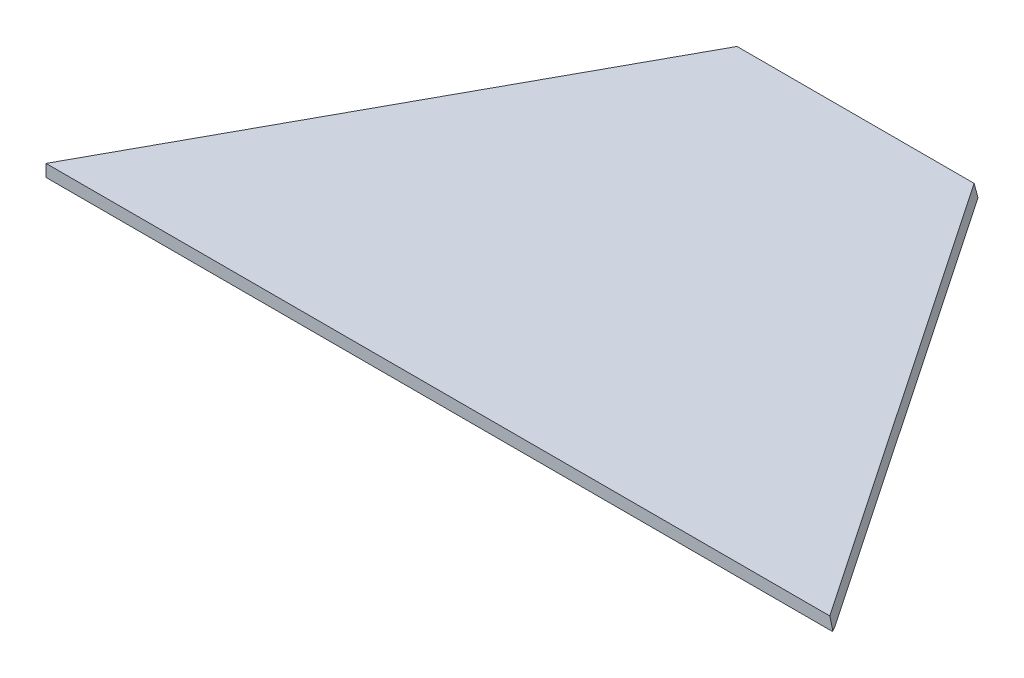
ISO-10303-21;
HEADER;
FILE_DESCRIPTION(('STEP AP214'),'2;1');
FILE_NAME('part.step','',(''),(''),'','','');
FILE_SCHEMA(('AUTOMOTIVE_DESIGN { 1 0 10303 214 1 1 1 1 }'));
ENDSEC;
DATA;
#1=APPLICATION_CONTEXT('core data for automotive mechanical design processes');
#2=APPLICATION_PROTOCOL_DEFINITION('international standard','automotive_design',2000,#1);
#3=PRODUCT_CONTEXT('',#1,'mechanical');
#4=PRODUCT('Part','Part','',(#3));
#5=PRODUCT_RELATED_PRODUCT_CATEGORY('part','',(#4));
#6=PRODUCT_DEFINITION_FORMATION('','',#4);
#7=PRODUCT_DEFINITION_CONTEXT('part definition',#1,'design');
#8=PRODUCT_DEFINITION('design','',#6,#7);
#9=PRODUCT_DEFINITION_SHAPE('','',#8);
#10=(LENGTH_UNIT() NAMED_UNIT(*) SI_UNIT(.MILLI.,.METRE.));
#11=(NAMED_UNIT(*) PLANE_ANGLE_UNIT() SI_UNIT($,.RADIAN.));
#12=(NAMED_UNIT(*) SI_UNIT($,.STERADIAN.) SOLID_ANGLE_UNIT());
#13=UNCERTAINTY_MEASURE_WITH_UNIT(LENGTH_MEASURE(1.E-05),#10,'distance_accuracy_value','');
#14=(GEOMETRIC_REPRESENTATION_CONTEXT(3) GLOBAL_UNCERTAINTY_ASSIGNED_CONTEXT((#13)) GLOBAL_UNIT_ASSIGNED_CONTEXT((#10,
#11,#12)) REPRESENTATION_CONTEXT('',''));
#15=CARTESIAN_POINT('',(0.,0.,0.));
#16=DIRECTION('',(0.,0.,1.));
#17=DIRECTION('',(1.,0.,0.));
#18=AXIS2_PLACEMENT_3D('',#15,#16,#17);
#19=CARTESIAN_POINT('',(-97.,3.,0.));
#20=DIRECTION('',(0.,1.,0.));
#21=DIRECTION('',(0.,0.,1.));
#22=AXIS2_PLACEMENT_3D('',#19,#20,#21);
#23=PLANE('',#22);
#24=DIRECTION('',(-0.560518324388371,0.,-0.828142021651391));
#25=VECTOR('',#24,1.);
#26=CARTESIAN_POINT('',(35.5795951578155,3.,-89.7349616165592));
#27=LINE('',#26,#25);
#28=CARTESIAN_POINT('',(96.3156633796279,3.,0.));
#29=VERTEX_POINT('',#28);
#30=CARTESIAN_POINT('',(21.7271433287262,3.00000000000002,-110.201370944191));
#31=VERTEX_POINT('',#30);
#32=EDGE_CURVE('E121',#29,#31,#27,.T.);
#33=ORIENTED_EDGE('',*,*,#32,.T.);
#34=DIRECTION('',(-1.,0.,0.));
#35=VECTOR('',#34,1.);
#36=CARTESIAN_POINT('',(-97.0000000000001,3.,-110.201370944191));
#37=LINE('',#36,#35);
#38=CARTESIAN_POINT('',(-36.7656214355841,3.,-110.201370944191));
#39=VERTEX_POINT('',#38);
#40=EDGE_CURVE('E99',#31,#39,#37,.T.);
#41=ORIENTED_EDGE('',*,*,#40,.T.);
#42=DIRECTION('',(-0.479616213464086,0.,0.877478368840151));
#43=VECTOR('',#42,1.);
#44=CARTESIAN_POINT('',(-22.1190534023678,3.,-136.997893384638));
#45=LINE('',#44,#43);
#46=CARTESIAN_POINT('',(-97.,3.,0.));
#47=VERTEX_POINT('',#46);
#48=EDGE_CURVE('E49',#39,#47,#45,.T.);
#49=ORIENTED_EDGE('',*,*,#48,.T.);
#50=DIRECTION('',(1.,0.,0.));
#51=VECTOR('',#50,1.);
#52=CARTESIAN_POINT('',(97.,3.,0.));
#53=LINE('',#52,#51);
#54=EDGE_CURVE('E105',#47,#29,#53,.T.);
#55=ORIENTED_EDGE('',*,*,#54,.T.);
#56=EDGE_LOOP('',(#33,#41,#49,#55));
#57=FACE_BOUND('',#56,.T.);
#58=ADVANCED_FACE('F33',(#57),#23,.T.);
#59=CARTESIAN_POINT('',(-97.,0.,0.));
#60=DIRECTION('',(0.,1.,0.));
#61=DIRECTION('',(0.,0.,1.));
#62=AXIS2_PLACEMENT_3D('',#59,#60,#61);
#63=PLANE('',#62);
#64=DIRECTION('',(-0.479616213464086,0.,0.877478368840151));
#65=VECTOR('',#64,1.);
#66=CARTESIAN_POINT('',(-22.1190534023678,0.,-136.997893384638));
#67=LINE('',#66,#65);
#68=CARTESIAN_POINT('',(-36.5561967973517,0.,-110.584522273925));
#69=VERTEX_POINT('',#68);
#70=CARTESIAN_POINT('',(-97.,0.,0.));
#71=VERTEX_POINT('',#70);
#72=EDGE_CURVE('E97',#69,#71,#67,.T.);
#73=ORIENTED_EDGE('',*,*,#72,.F.);
#74=DIRECTION('',(-1.,0.,0.));
#75=VECTOR('',#74,1.);
#76=CARTESIAN_POINT('',(-97.0000000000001,0.,-110.584522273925));
#77=LINE('',#76,#75);
#78=CARTESIAN_POINT('',(22.292589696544,0.,-110.584522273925));
#79=VERTEX_POINT('',#78);
#80=EDGE_CURVE('E42',#79,#69,#77,.T.);
#81=ORIENTED_EDGE('',*,*,#80,.F.);
#82=DIRECTION('',(-0.560518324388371,0.,-0.828142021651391));
#83=VECTOR('',#82,1.);
#84=CARTESIAN_POINT('',(36.1452436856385,0.,-90.1178142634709));
#85=LINE('',#84,#83);
#86=CARTESIAN_POINT('',(96.4106653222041,0.,-1.07821299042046));
#87=VERTEX_POINT('',#86);
#88=EDGE_CURVE('E11',#87,#79,#85,.T.);
#89=ORIENTED_EDGE('',*,*,#88,.F.);
#90=DIRECTION('',(-0.479616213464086,0.,-0.877478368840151));
#91=VECTOR('',#90,1.);
#92=CARTESIAN_POINT('',(22.1190534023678,0.,-136.997893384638));
#93=LINE('',#92,#91);
#94=CARTESIAN_POINT('',(97.,0.,0.));
#95=VERTEX_POINT('',#94);
#96=EDGE_CURVE('E106',#95,#87,#93,.T.);
#97=ORIENTED_EDGE('',*,*,#96,.F.);
#98=DIRECTION('',(1.,0.,0.));
#99=VECTOR('',#98,1.);
#100=CARTESIAN_POINT('',(97.,0.,0.));
#101=LINE('',#100,#99);
#102=EDGE_CURVE('E104',#71,#95,#101,.T.);
#103=ORIENTED_EDGE('',*,*,#102,.F.);
#104=EDGE_LOOP('',(#73,#81,#89,#97,#103));
#105=FACE_BOUND('',#104,.T.);
#106=ADVANCED_FACE('F102',(#105),#63,.F.);
#107=CARTESIAN_POINT('',(-22.1190534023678,3.,-136.997893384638));
#108=DIRECTION('',(0.877478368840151,0.,0.479616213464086));
#109=DIRECTION('',(0.479616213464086,0.,-0.877478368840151));
#110=AXIS2_PLACEMENT_3D('',#107,#108,#109);
#111=PLANE('',#110);
#112=DIRECTION('',(-0.0690803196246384,0.989572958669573,0.126385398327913));
#113=VECTOR('',#112,1.);
#114=CARTESIAN_POINT('',(-36.461773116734,-1.35261564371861,-110.757274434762));
#115=LINE('',#114,#113);
#116=EDGE_CURVE('E91',#69,#39,#115,.T.);
#117=ORIENTED_EDGE('',*,*,#116,.F.);
#118=ORIENTED_EDGE('',*,*,#72,.T.);
#119=DIRECTION('',(0.,-1.,0.));
#120=VECTOR('',#119,1.);
#121=CARTESIAN_POINT('',(-97.,3.,0.));
#122=LINE('',#121,#120);
#123=EDGE_CURVE('E112',#47,#71,#122,.T.);
#124=ORIENTED_EDGE('',*,*,#123,.F.);
#125=ORIENTED_EDGE('',*,*,#48,.F.);
#126=EDGE_LOOP('',(#117,#118,#124,#125));
#127=FACE_BOUND('',#126,.T.);
#128=ADVANCED_FACE('F96',(#127),#111,.F.);
#129=CARTESIAN_POINT('',(97.2913262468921,2.89180877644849,1.39755410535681));
#130=DIRECTION('',(0.807477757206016,0.221996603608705,-0.546531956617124));
#131=DIRECTION('',(-0.560539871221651,0.000114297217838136,-0.828127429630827));
#132=AXIS2_PLACEMENT_3D('',#129,#130,#131);
#133=PLANE('',#132);
#134=DIRECTION('',(-0.183779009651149,0.975047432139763,0.124530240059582));
#135=VECTOR('',#134,1.);
#136=CARTESIAN_POINT('',(21.7446319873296,2.90721317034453,-110.213221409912));
#137=LINE('',#136,#135);
#138=EDGE_CURVE('E92',#79,#31,#137,.T.);
#139=ORIENTED_EDGE('',*,*,#138,.T.);
#140=ORIENTED_EDGE('',*,*,#32,.F.);
#141=DIRECTION('',(0.265090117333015,-0.964223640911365,0.));
#142=VECTOR('',#141,1.);
#143=CARTESIAN_POINT('',(96.3637536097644,2.8250793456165,0.));
#144=LINE('',#143,#142);
#145=CARTESIAN_POINT('',(97.,0.510833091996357,0.));
#146=VERTEX_POINT('',#145);
#147=EDGE_CURVE('E69',#29,#146,#144,.T.);
#148=ORIENTED_EDGE('',*,*,#147,.T.);
#149=DIRECTION('',(-0.442869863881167,-0.383877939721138,-0.810249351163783));
#150=VECTOR('',#149,1.);
#151=CARTESIAN_POINT('',(33.5768580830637,-54.4641088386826,-116.035349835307));
#152=LINE('',#151,#150);
#153=EDGE_CURVE('E71',#146,#87,#152,.T.);
#154=ORIENTED_EDGE('',*,*,#153,.T.);
#155=ORIENTED_EDGE('',*,*,#88,.T.);
#156=EDGE_LOOP('',(#139,#140,#148,#154,#155));
#157=FACE_BOUND('',#156,.T.);
#158=ADVANCED_FACE('F124',(#157),#133,.T.);
#159=CARTESIAN_POINT('',(97.,3.,0.));
#160=DIRECTION('',(0.,0.,-1.));
#161=DIRECTION('',(-1.,0.,0.));
#162=AXIS2_PLACEMENT_3D('',#159,#160,#161);
#163=PLANE('',#162);
#164=ORIENTED_EDGE('',*,*,#147,.F.);
#165=ORIENTED_EDGE('',*,*,#54,.F.);
#166=ORIENTED_EDGE('',*,*,#123,.T.);
#167=ORIENTED_EDGE('',*,*,#102,.T.);
#168=DIRECTION('',(0.,-1.,0.));
#169=VECTOR('',#168,1.);
#170=CARTESIAN_POINT('',(97.,3.,0.));
#171=LINE('',#170,#169);
#172=EDGE_CURVE('E61',#146,#95,#171,.T.);
#173=ORIENTED_EDGE('',*,*,#172,.F.);
#174=EDGE_LOOP('',(#164,#165,#166,#167,#173));
#175=FACE_BOUND('',#174,.T.);
#176=ADVANCED_FACE('F35',(#175),#163,.F.);
#177=CARTESIAN_POINT('',(22.3402439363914,2.97638784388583,-110.204386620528));
#178=DIRECTION('',(0.,0.126688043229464,-0.991942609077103));
#179=DIRECTION('',(-1.,0.,0.));
#180=AXIS2_PLACEMENT_3D('',#177,#178,#179);
#181=PLANE('',#180);
#182=ORIENTED_EDGE('',*,*,#40,.F.);
#183=ORIENTED_EDGE('',*,*,#138,.F.);
#184=ORIENTED_EDGE('',*,*,#80,.T.);
#185=ORIENTED_EDGE('',*,*,#116,.T.);
#186=EDGE_LOOP('',(#182,#183,#184,#185));
#187=FACE_BOUND('',#186,.T.);
#188=ADVANCED_FACE('F90',(#187),#181,.T.);
#189=CARTESIAN_POINT('',(22.1190534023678,3.,-136.997893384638));
#190=DIRECTION('',(-0.877478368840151,0.,0.479616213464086));
#191=DIRECTION('',(0.479616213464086,0.,0.877478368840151));
#192=AXIS2_PLACEMENT_3D('',#189,#190,#191);
#193=PLANE('',#192);
#194=ORIENTED_EDGE('',*,*,#153,.F.);
#195=ORIENTED_EDGE('',*,*,#172,.T.);
#196=ORIENTED_EDGE('',*,*,#96,.T.);
#197=EDGE_LOOP('',(#194,#195,#196));
#198=FACE_BOUND('',#197,.T.);
#199=ADVANCED_FACE('F125',(#198),#193,.F.);
#200=CLOSED_SHELL('',(#58,#106,#128,#158,#176,#188,#199));
#201=MANIFOLD_SOLID_BREP('B2',#200);
#202=ADVANCED_BREP_SHAPE_REPRESENTATION('',(#18,#201),#14);
#203=SHAPE_DEFINITION_REPRESENTATION(#9,#202);
ENDSEC;
END-ISO-10303-21;
